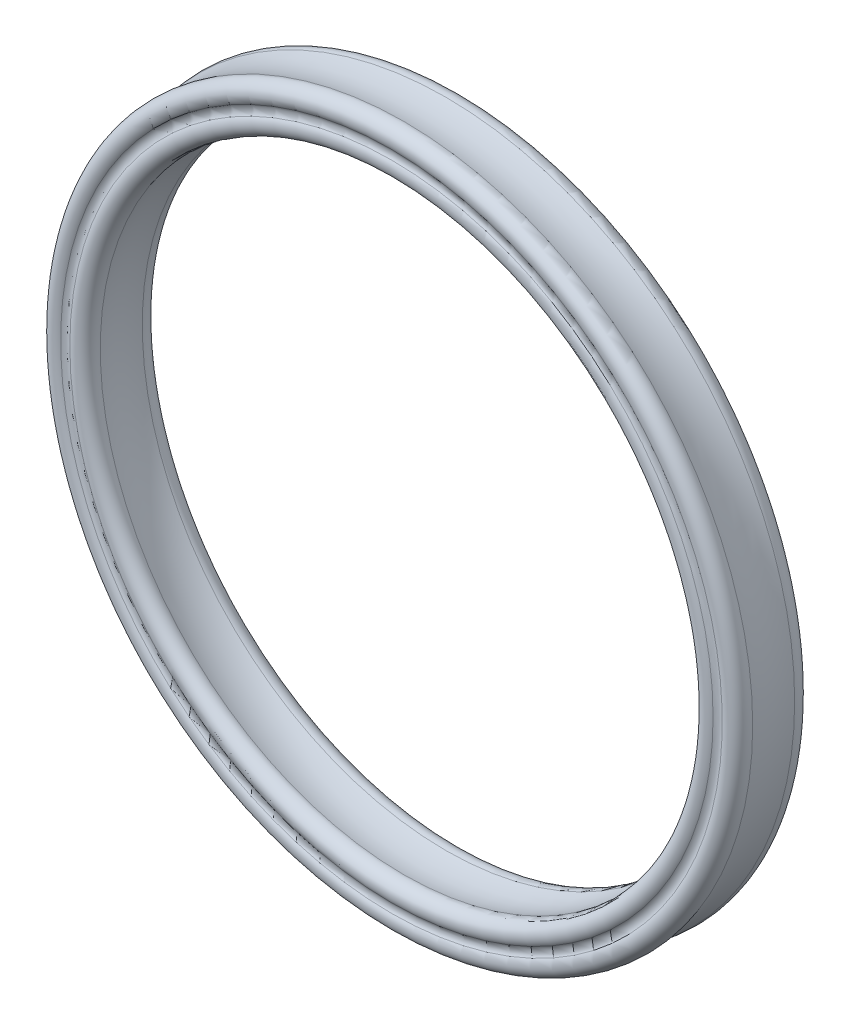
ISO-10303-21;
HEADER;
FILE_DESCRIPTION(('STEP AP214'),'2;1');
FILE_NAME('part.step','',(''),(''),'','','');
FILE_SCHEMA(('AUTOMOTIVE_DESIGN { 1 0 10303 214 1 1 1 1 }'));
ENDSEC;
DATA;
#1=APPLICATION_CONTEXT('core data for automotive mechanical design processes');
#2=APPLICATION_PROTOCOL_DEFINITION('international standard','automotive_design',2000,#1);
#3=PRODUCT_CONTEXT('',#1,'mechanical');
#4=PRODUCT('Part','Part','',(#3));
#5=PRODUCT_RELATED_PRODUCT_CATEGORY('part','',(#4));
#6=PRODUCT_DEFINITION_FORMATION('','',#4);
#7=PRODUCT_DEFINITION_CONTEXT('part definition',#1,'design');
#8=PRODUCT_DEFINITION('design','',#6,#7);
#9=PRODUCT_DEFINITION_SHAPE('','',#8);
#10=(LENGTH_UNIT() NAMED_UNIT(*) SI_UNIT(.MILLI.,.METRE.));
#11=(NAMED_UNIT(*) PLANE_ANGLE_UNIT() SI_UNIT($,.RADIAN.));
#12=(NAMED_UNIT(*) SI_UNIT($,.STERADIAN.) SOLID_ANGLE_UNIT());
#13=UNCERTAINTY_MEASURE_WITH_UNIT(LENGTH_MEASURE(1.E-05),#10,'distance_accuracy_value','');
#14=(GEOMETRIC_REPRESENTATION_CONTEXT(3) GLOBAL_UNCERTAINTY_ASSIGNED_CONTEXT((#13)) GLOBAL_UNIT_ASSIGNED_CONTEXT((#10,
#11,#12)) REPRESENTATION_CONTEXT('',''));
#15=CARTESIAN_POINT('',(0.,0.,0.));
#16=DIRECTION('',(0.,0.,1.));
#17=DIRECTION('',(1.,0.,0.));
#18=AXIS2_PLACEMENT_3D('',#15,#16,#17);
#19=CARTESIAN_POINT('',(0.,0.,0.208333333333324));
#20=DIRECTION('',(0.,0.,1.));
#21=DIRECTION('',(0.,-1.,0.));
#22=AXIS2_PLACEMENT_3D('',#19,#20,#21);
#23=TOROIDAL_SURFACE('',#22,17.75,0.416666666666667);
#24=CARTESIAN_POINT('',(0.,0.,-0.125));
#25=DIRECTION('',(0.,0.,1.));
#26=DIRECTION('',(0.,-1.,0.));
#27=AXIS2_PLACEMENT_3D('',#24,#25,#26);
#28=CIRCLE('',#27,17.5);
#29=CARTESIAN_POINT('',(0.,-17.5,-0.125000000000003));
#30=VERTEX_POINT('',#29);
#31=EDGE_CURVE('E10',#30,#30,#28,.T.);
#32=ORIENTED_EDGE('',*,*,#31,.F.);
#33=EDGE_LOOP('',(#32));
#34=FACE_BOUND('',#33,.T.);
#35=CARTESIAN_POINT('',(0.,0.,-0.125));
#36=DIRECTION('',(0.,0.,1.));
#37=DIRECTION('',(0.,-1.,0.));
#38=AXIS2_PLACEMENT_3D('',#35,#36,#37);
#39=CIRCLE('',#38,18.);
#40=CARTESIAN_POINT('',(0.,-18.,-0.125000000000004));
#41=VERTEX_POINT('',#40);
#42=EDGE_CURVE('E55',#41,#41,#39,.T.);
#43=ORIENTED_EDGE('',*,*,#42,.T.);
#44=EDGE_LOOP('',(#43));
#45=FACE_BOUND('',#44,.T.);
#46=ADVANCED_FACE('F27',(#34,#45),#23,.F.);
#47=CARTESIAN_POINT('',(0.,0.,-0.625000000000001));
#48=DIRECTION('',(0.,0.,1.));
#49=DIRECTION('',(0.,-1.,0.));
#50=AXIS2_PLACEMENT_3D('',#47,#48,#49);
#51=TOROIDAL_SURFACE('',#50,17.125,0.625000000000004);
#52=CARTESIAN_POINT('',(0.,0.,-0.808011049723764));
#53=DIRECTION('',(0.,0.,1.));
#54=DIRECTION('',(0.,-1.,0.));
#55=AXIS2_PLACEMENT_3D('',#52,#53,#54);
#56=CIRCLE('',#55,16.5273948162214);
#57=CARTESIAN_POINT('',(0.,-16.5273948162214,-0.808011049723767));
#58=VERTEX_POINT('',#57);
#59=EDGE_CURVE('E33',#58,#58,#56,.T.);
#60=ORIENTED_EDGE('',*,*,#59,.F.);
#61=EDGE_LOOP('',(#60));
#62=FACE_BOUND('',#61,.T.);
#63=ORIENTED_EDGE('',*,*,#31,.T.);
#64=EDGE_LOOP('',(#63));
#65=FACE_BOUND('',#64,.T.);
#66=ADVANCED_FACE('F92',(#62,#65),#51,.T.);
#67=CARTESIAN_POINT('',(0.,0.,-1.95000000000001));
#68=DIRECTION('',(0.,0.,1.));
#69=DIRECTION('',(0.,-1.,0.));
#70=AXIS2_PLACEMENT_3D('',#67,#68,#69);
#71=TOROIDAL_SURFACE('',#70,12.7983384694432,3.89999999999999);
#72=CARTESIAN_POINT('',(0.,0.,-3.09198895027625));
#73=DIRECTION('',(0.,0.,1.));
#74=DIRECTION('',(0.,-1.,0.));
#75=AXIS2_PLACEMENT_3D('',#72,#73,#74);
#76=CIRCLE('',#75,16.5273948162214);
#77=CARTESIAN_POINT('',(0.,-16.5273948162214,-3.09198895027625));
#78=VERTEX_POINT('',#77);
#79=EDGE_CURVE('E37',#78,#78,#76,.T.);
#80=ORIENTED_EDGE('',*,*,#79,.F.);
#81=EDGE_LOOP('',(#80));
#82=FACE_BOUND('',#81,.T.);
#83=ORIENTED_EDGE('',*,*,#59,.T.);
#84=EDGE_LOOP('',(#83));
#85=FACE_BOUND('',#84,.T.);
#86=ADVANCED_FACE('F87',(#82,#85),#71,.F.);
#87=CARTESIAN_POINT('',(0.,0.,-3.275));
#88=DIRECTION('',(0.,0.,1.));
#89=DIRECTION('',(0.,-1.,0.));
#90=AXIS2_PLACEMENT_3D('',#87,#88,#89);
#91=TOROIDAL_SURFACE('',#90,17.125,0.625000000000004);
#92=CARTESIAN_POINT('',(0.,0.,-3.775));
#93=DIRECTION('',(0.,0.,1.));
#94=DIRECTION('',(0.,-1.,0.));
#95=AXIS2_PLACEMENT_3D('',#92,#93,#94);
#96=CIRCLE('',#95,17.5);
#97=CARTESIAN_POINT('',(0.,-17.5,-3.775));
#98=VERTEX_POINT('',#97);
#99=EDGE_CURVE('E41',#98,#98,#96,.T.);
#100=ORIENTED_EDGE('',*,*,#99,.F.);
#101=EDGE_LOOP('',(#100));
#102=FACE_BOUND('',#101,.T.);
#103=ORIENTED_EDGE('',*,*,#79,.T.);
#104=EDGE_LOOP('',(#103));
#105=FACE_BOUND('',#104,.T.);
#106=ADVANCED_FACE('F81',(#102,#105),#91,.T.);
#107=CARTESIAN_POINT('',(0.,0.,-4.10833333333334));
#108=DIRECTION('',(0.,0.,1.));
#109=DIRECTION('',(0.,-1.,0.));
#110=AXIS2_PLACEMENT_3D('',#107,#108,#109);
#111=TOROIDAL_SURFACE('',#110,17.75,0.416666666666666);
#112=CARTESIAN_POINT('',(0.,0.,-3.775));
#113=DIRECTION('',(0.,0.,1.));
#114=DIRECTION('',(0.,-1.,0.));
#115=AXIS2_PLACEMENT_3D('',#112,#113,#114);
#116=CIRCLE('',#115,18.);
#117=CARTESIAN_POINT('',(0.,-18.,-3.775));
#118=VERTEX_POINT('',#117);
#119=EDGE_CURVE('E46',#118,#118,#116,.T.);
#120=ORIENTED_EDGE('',*,*,#119,.F.);
#121=EDGE_LOOP('',(#120));
#122=FACE_BOUND('',#121,.T.);
#123=ORIENTED_EDGE('',*,*,#99,.T.);
#124=EDGE_LOOP('',(#123));
#125=FACE_BOUND('',#124,.T.);
#126=ADVANCED_FACE('F75',(#122,#125),#111,.F.);
#127=CARTESIAN_POINT('',(0.,0.,-3.275));
#128=DIRECTION('',(0.,0.,1.));
#129=DIRECTION('',(0.,-1.,0.));
#130=AXIS2_PLACEMENT_3D('',#127,#128,#129);
#131=TOROIDAL_SURFACE('',#130,18.375,0.625000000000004);
#132=CARTESIAN_POINT('',(0.,0.,-3.09198895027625));
#133=DIRECTION('',(0.,0.,1.));
#134=DIRECTION('',(0.,-1.,0.));
#135=AXIS2_PLACEMENT_3D('',#132,#133,#134);
#136=CIRCLE('',#135,18.9726051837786);
#137=CARTESIAN_POINT('',(0.,-18.9726051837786,-3.09198895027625));
#138=VERTEX_POINT('',#137);
#139=EDGE_CURVE('E49',#138,#138,#136,.T.);
#140=ORIENTED_EDGE('',*,*,#139,.F.);
#141=EDGE_LOOP('',(#140));
#142=FACE_BOUND('',#141,.T.);
#143=ORIENTED_EDGE('',*,*,#119,.T.);
#144=EDGE_LOOP('',(#143));
#145=FACE_BOUND('',#144,.T.);
#146=ADVANCED_FACE('F69',(#142,#145),#131,.T.);
#147=CARTESIAN_POINT('',(0.,0.,-1.95000000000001));
#148=DIRECTION('',(0.,0.,1.));
#149=DIRECTION('',(0.,-1.,0.));
#150=AXIS2_PLACEMENT_3D('',#147,#148,#149);
#151=TOROIDAL_SURFACE('',#150,22.7016615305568,3.89999999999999);
#152=CARTESIAN_POINT('',(0.,0.,-0.808011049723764));
#153=DIRECTION('',(0.,0.,1.));
#154=DIRECTION('',(0.,-1.,0.));
#155=AXIS2_PLACEMENT_3D('',#152,#153,#154);
#156=CIRCLE('',#155,18.9726051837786);
#157=CARTESIAN_POINT('',(0.,-18.9726051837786,-0.808011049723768));
#158=VERTEX_POINT('',#157);
#159=EDGE_CURVE('E52',#158,#158,#156,.T.);
#160=ORIENTED_EDGE('',*,*,#159,.F.);
#161=EDGE_LOOP('',(#160));
#162=FACE_BOUND('',#161,.T.);
#163=ORIENTED_EDGE('',*,*,#139,.T.);
#164=EDGE_LOOP('',(#163));
#165=FACE_BOUND('',#164,.T.);
#166=ADVANCED_FACE('F63',(#162,#165),#151,.F.);
#167=CARTESIAN_POINT('',(0.,0.,-0.625000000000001));
#168=DIRECTION('',(0.,0.,1.));
#169=DIRECTION('',(0.,-1.,0.));
#170=AXIS2_PLACEMENT_3D('',#167,#168,#169);
#171=TOROIDAL_SURFACE('',#170,18.375,0.625000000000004);
#172=ORIENTED_EDGE('',*,*,#42,.F.);
#173=EDGE_LOOP('',(#172));
#174=FACE_BOUND('',#173,.T.);
#175=ORIENTED_EDGE('',*,*,#159,.T.);
#176=EDGE_LOOP('',(#175));
#177=FACE_BOUND('',#176,.T.);
#178=ADVANCED_FACE('F60',(#174,#177),#171,.T.);
#179=CLOSED_SHELL('',(#46,#66,#86,#106,#126,#146,#166,#178));
#180=MANIFOLD_SOLID_BREP('B2',#179);
#181=ADVANCED_BREP_SHAPE_REPRESENTATION('',(#18,#180),#14);
#182=SHAPE_DEFINITION_REPRESENTATION(#9,#181);
ENDSEC;
END-ISO-10303-21;
